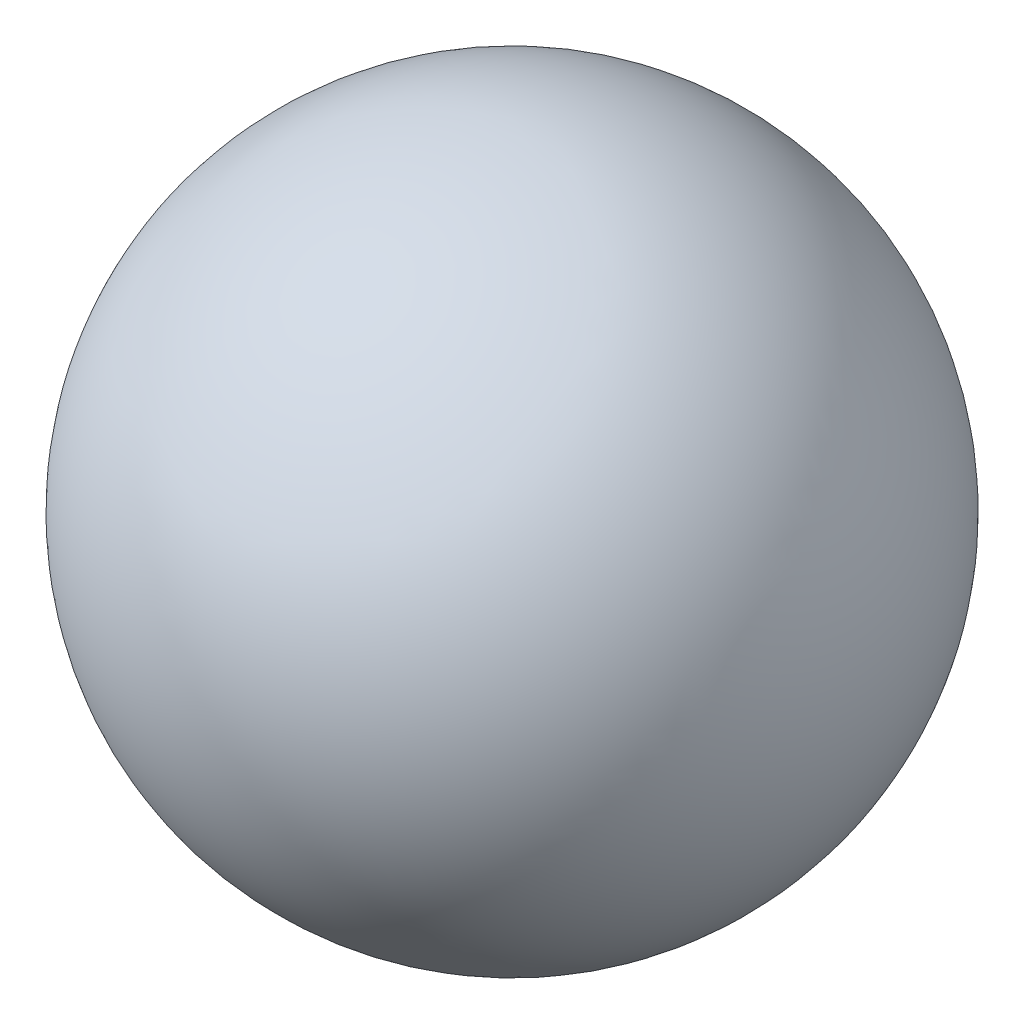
from build123d import *


with BuildPart() as part:
    # Sketch1 → Revolve1 (revolve)
    with BuildSketch(Plane.XY):
        with BuildLine():
            Line((3.69, 6.5), (1.31, 6.5))
            ThreePointArc((1.31, 6.5), (2.5, 7.69), (3.69, 6.5))
        make_face()
    revolve(axis=Axis((50, 6.5, 0), (-1, 0, 0)))


solid = part.part
